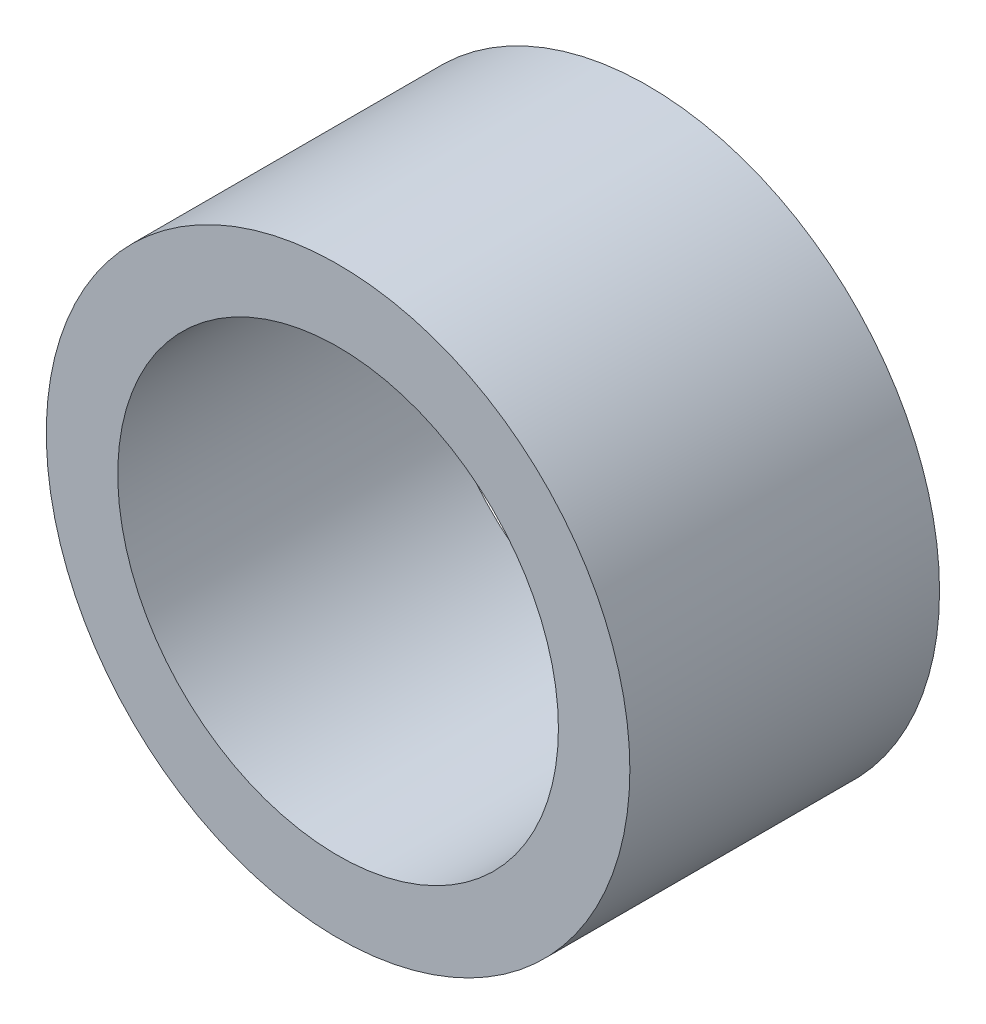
ISO-10303-21;
HEADER;
FILE_DESCRIPTION(('STEP AP214'),'2;1');
FILE_NAME('part.step','',(''),(''),'','','');
FILE_SCHEMA(('AUTOMOTIVE_DESIGN { 1 0 10303 214 1 1 1 1 }'));
ENDSEC;
DATA;
#1=APPLICATION_CONTEXT('core data for automotive mechanical design processes');
#2=APPLICATION_PROTOCOL_DEFINITION('international standard','automotive_design',2000,#1);
#3=PRODUCT_CONTEXT('',#1,'mechanical');
#4=PRODUCT('Part','Part','',(#3));
#5=PRODUCT_RELATED_PRODUCT_CATEGORY('part','',(#4));
#6=PRODUCT_DEFINITION_FORMATION('','',#4);
#7=PRODUCT_DEFINITION_CONTEXT('part definition',#1,'design');
#8=PRODUCT_DEFINITION('design','',#6,#7);
#9=PRODUCT_DEFINITION_SHAPE('','',#8);
#10=(LENGTH_UNIT() NAMED_UNIT(*) SI_UNIT(.MILLI.,.METRE.));
#11=(NAMED_UNIT(*) PLANE_ANGLE_UNIT() SI_UNIT($,.RADIAN.));
#12=(NAMED_UNIT(*) SI_UNIT($,.STERADIAN.) SOLID_ANGLE_UNIT());
#13=UNCERTAINTY_MEASURE_WITH_UNIT(LENGTH_MEASURE(1.E-05),#10,'distance_accuracy_value','');
#14=(GEOMETRIC_REPRESENTATION_CONTEXT(3) GLOBAL_UNCERTAINTY_ASSIGNED_CONTEXT((#13)) GLOBAL_UNIT_ASSIGNED_CONTEXT((#10,
#11,#12)) REPRESENTATION_CONTEXT('',''));
#15=CARTESIAN_POINT('',(0.,0.,0.));
#16=DIRECTION('',(0.,0.,1.));
#17=DIRECTION('',(1.,0.,0.));
#18=AXIS2_PLACEMENT_3D('',#15,#16,#17);
#19=CARTESIAN_POINT('',(0.,0.,-13.));
#20=DIRECTION('',(0.,0.,1.));
#21=DIRECTION('',(1.,0.,0.));
#22=AXIS2_PLACEMENT_3D('',#19,#20,#21);
#23=CYLINDRICAL_SURFACE('',#22,12.25);
#24=CARTESIAN_POINT('',(0.,0.,-13.));
#25=DIRECTION('',(0.,0.,1.));
#26=DIRECTION('',(1.,0.,0.));
#27=AXIS2_PLACEMENT_3D('',#24,#25,#26);
#28=CIRCLE('',#27,12.25);
#29=CARTESIAN_POINT('',(12.25,0.,-13.));
#30=VERTEX_POINT('',#29);
#31=EDGE_CURVE('E11',#30,#30,#28,.T.);
#32=CARTESIAN_POINT('',(0.,0.,0.));
#33=DIRECTION('',(0.,0.,1.));
#34=DIRECTION('',(1.,0.,0.));
#35=AXIS2_PLACEMENT_3D('',#32,#33,#34);
#36=CIRCLE('',#35,12.25);
#37=CARTESIAN_POINT('',(12.25,0.,0.));
#38=VERTEX_POINT('',#37);
#39=EDGE_CURVE('E44',#38,#38,#36,.T.);
#40=CARTESIAN_POINT('',(12.25,0.,-13.));
#41=CARTESIAN_POINT('',(12.25,0.,-12.8645833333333));
#42=CARTESIAN_POINT('',(12.25,0.,-12.7291666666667));
#43=CARTESIAN_POINT('',(12.25,0.,-12.4583333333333));
#44=CARTESIAN_POINT('',(12.25,0.,-12.3229166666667));
#45=CARTESIAN_POINT('',(12.25,0.,-12.0520833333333));
#46=CARTESIAN_POINT('',(12.25,0.,-11.9166666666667));
#47=CARTESIAN_POINT('',(12.25,0.,-11.6458333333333));
#48=CARTESIAN_POINT('',(12.25,0.,-11.5104166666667));
#49=CARTESIAN_POINT('',(12.25,0.,-11.2395833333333));
#50=CARTESIAN_POINT('',(12.25,0.,-11.1041666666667));
#51=CARTESIAN_POINT('',(12.25,0.,-10.8333333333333));
#52=CARTESIAN_POINT('',(12.25,0.,-10.6979166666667));
#53=CARTESIAN_POINT('',(12.25,0.,-10.4270833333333));
#54=CARTESIAN_POINT('',(12.25,0.,-10.2916666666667));
#55=CARTESIAN_POINT('',(12.25,0.,-10.0208333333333));
#56=CARTESIAN_POINT('',(12.25,0.,-9.88541666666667));
#57=CARTESIAN_POINT('',(12.25,0.,-9.61458333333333));
#58=CARTESIAN_POINT('',(12.25,0.,-9.47916666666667));
#59=CARTESIAN_POINT('',(12.25,0.,-9.20833333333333));
#60=CARTESIAN_POINT('',(12.25,0.,-9.07291666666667));
#61=CARTESIAN_POINT('',(12.25,0.,-8.80208333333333));
#62=CARTESIAN_POINT('',(12.25,0.,-8.66666666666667));
#63=CARTESIAN_POINT('',(12.25,0.,-8.39583333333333));
#64=CARTESIAN_POINT('',(12.25,0.,-8.26041666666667));
#65=CARTESIAN_POINT('',(12.25,0.,-7.98958333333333));
#66=CARTESIAN_POINT('',(12.25,0.,-7.85416666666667));
#67=CARTESIAN_POINT('',(12.25,0.,-7.58333333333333));
#68=CARTESIAN_POINT('',(12.25,0.,-7.44791666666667));
#69=CARTESIAN_POINT('',(12.25,0.,-7.17708333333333));
#70=CARTESIAN_POINT('',(12.25,0.,-7.04166666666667));
#71=CARTESIAN_POINT('',(12.25,0.,-6.77083333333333));
#72=CARTESIAN_POINT('',(12.25,0.,-6.63541666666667));
#73=CARTESIAN_POINT('',(12.25,0.,-6.36458333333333));
#74=CARTESIAN_POINT('',(12.25,0.,-6.22916666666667));
#75=CARTESIAN_POINT('',(12.25,0.,-5.95833333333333));
#76=CARTESIAN_POINT('',(12.25,0.,-5.82291666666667));
#77=CARTESIAN_POINT('',(12.25,0.,-5.55208333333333));
#78=CARTESIAN_POINT('',(12.25,0.,-5.41666666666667));
#79=CARTESIAN_POINT('',(12.25,0.,-5.14583333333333));
#80=CARTESIAN_POINT('',(12.25,0.,-5.01041666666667));
#81=CARTESIAN_POINT('',(12.25,0.,-4.73958333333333));
#82=CARTESIAN_POINT('',(12.25,0.,-4.60416666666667));
#83=CARTESIAN_POINT('',(12.25,0.,-4.33333333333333));
#84=CARTESIAN_POINT('',(12.25,0.,-4.19791666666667));
#85=CARTESIAN_POINT('',(12.25,0.,-3.92708333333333));
#86=CARTESIAN_POINT('',(12.25,0.,-3.79166666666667));
#87=CARTESIAN_POINT('',(12.25,0.,-3.52083333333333));
#88=CARTESIAN_POINT('',(12.25,0.,-3.38541666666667));
#89=CARTESIAN_POINT('',(12.25,0.,-3.11458333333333));
#90=CARTESIAN_POINT('',(12.25,0.,-2.97916666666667));
#91=CARTESIAN_POINT('',(12.25,0.,-2.70833333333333));
#92=CARTESIAN_POINT('',(12.25,0.,-2.57291666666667));
#93=CARTESIAN_POINT('',(12.25,0.,-2.30208333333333));
#94=CARTESIAN_POINT('',(12.25,0.,-2.16666666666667));
#95=CARTESIAN_POINT('',(12.25,0.,-1.89583333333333));
#96=CARTESIAN_POINT('',(12.25,0.,-1.76041666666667));
#97=CARTESIAN_POINT('',(12.25,0.,-1.48958333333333));
#98=CARTESIAN_POINT('',(12.25,0.,-1.35416666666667));
#99=CARTESIAN_POINT('',(12.25,0.,-1.08333333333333));
#100=CARTESIAN_POINT('',(12.25,0.,-0.947916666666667));
#101=CARTESIAN_POINT('',(12.25,0.,-0.677083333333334));
#102=CARTESIAN_POINT('',(12.25,0.,-0.541666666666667));
#103=CARTESIAN_POINT('',(12.25,0.,-0.270833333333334));
#104=CARTESIAN_POINT('',(12.25,0.,-0.135416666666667));
#105=CARTESIAN_POINT('',(12.25,0.,0.));
#106=B_SPLINE_CURVE_WITH_KNOTS('',3,(#40,#41,#42,#43,#44,#45,#46,#47,#48,#49,#50,#51,#52,#53,
#54,#55,#56,#57,#58,#59,#60,#61,#62,#63,#64,#65,#66,#67,#68,#69,#70,#71,#72,#73,#74,#75,#76,#77,
#78,#79,#80,#81,#82,#83,#84,#85,#86,#87,#88,#89,#90,#91,#92,#93,#94,#95,#96,#97,#98,#99,#100,
#101,#102,#103,#104,#105),.UNSPECIFIED.,.F.,.F.,(4,2,2,2,2,2,2,2,2,2,2,2,2,2,2,2,2,2,2,2,2,2,2,
2,2,2,2,2,2,2,2,2,4),(0.,0.406249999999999,0.812499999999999,1.21875,1.625,2.03125,2.4375,
2.84375,3.25,3.65625,4.0625,4.46875,4.875,5.28125,5.6875,6.09375,6.5,6.90625,7.3125,7.71875,
8.125,8.53125,8.9375,9.34375,9.75,10.15625,10.5625,10.96875,11.375,11.78125,12.1875,12.59375,
13.),.UNSPECIFIED.);
#107=EDGE_CURVE('BSEAM41',#30,#38,#106,.T.);
#108=ORIENTED_EDGE('',*,*,#31,.T.);
#109=ORIENTED_EDGE('',*,*,#39,.F.);
#110=ORIENTED_EDGE('',*,*,#107,.T.);
#111=ORIENTED_EDGE('',*,*,#107,.F.);
#112=EDGE_LOOP('',(#108,#110,#109,#111));
#113=FACE_BOUND('',#112,.T.);
#114=ADVANCED_FACE('F41',(#113),#23,.T.);
#115=CARTESIAN_POINT('',(0.,0.,-13.));
#116=DIRECTION('',(0.,0.,1.));
#117=DIRECTION('',(1.,0.,0.));
#118=AXIS2_PLACEMENT_3D('',#115,#116,#117);
#119=PLANE('',#118);
#120=CARTESIAN_POINT('',(0.,0.,-13.));
#121=DIRECTION('',(0.,0.,1.));
#122=DIRECTION('',(1.,0.,0.));
#123=AXIS2_PLACEMENT_3D('',#120,#121,#122);
#124=CIRCLE('',#123,9.25);
#125=CARTESIAN_POINT('',(9.25,0.,-13.));
#126=VERTEX_POINT('',#125);
#127=EDGE_CURVE('E51',#126,#126,#124,.T.);
#128=ORIENTED_EDGE('',*,*,#127,.T.);
#129=EDGE_LOOP('',(#128));
#130=FACE_BOUND('',#129,.T.);
#131=ORIENTED_EDGE('',*,*,#31,.F.);
#132=EDGE_LOOP('',(#131));
#133=FACE_BOUND('',#132,.T.);
#134=ADVANCED_FACE('F59',(#130,#133),#119,.F.);
#135=CARTESIAN_POINT('',(0.,0.,0.));
#136=DIRECTION('',(0.,0.,1.));
#137=DIRECTION('',(1.,0.,0.));
#138=AXIS2_PLACEMENT_3D('',#135,#136,#137);
#139=PLANE('',#138);
#140=CARTESIAN_POINT('',(0.,0.,0.));
#141=DIRECTION('',(0.,0.,1.));
#142=DIRECTION('',(1.,0.,0.));
#143=AXIS2_PLACEMENT_3D('',#140,#141,#142);
#144=CIRCLE('',#143,9.25);
#145=CARTESIAN_POINT('',(9.25,0.,0.));
#146=VERTEX_POINT('',#145);
#147=EDGE_CURVE('E53',#146,#146,#144,.T.);
#148=ORIENTED_EDGE('',*,*,#147,.F.);
#149=EDGE_LOOP('',(#148));
#150=FACE_BOUND('',#149,.T.);
#151=ORIENTED_EDGE('',*,*,#39,.T.);
#152=EDGE_LOOP('',(#151));
#153=FACE_BOUND('',#152,.T.);
#154=ADVANCED_FACE('F65',(#150,#153),#139,.T.);
#155=CARTESIAN_POINT('',(0.,0.,-13.));
#156=DIRECTION('',(0.,0.,1.));
#157=DIRECTION('',(1.,0.,0.));
#158=AXIS2_PLACEMENT_3D('',#155,#156,#157);
#159=CYLINDRICAL_SURFACE('',#158,9.25);
#160=CARTESIAN_POINT('',(9.25,0.,-13.));
#161=CARTESIAN_POINT('',(9.25,0.,-12.8645833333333));
#162=CARTESIAN_POINT('',(9.25,0.,-12.7291666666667));
#163=CARTESIAN_POINT('',(9.25,0.,-12.4583333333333));
#164=CARTESIAN_POINT('',(9.25,0.,-12.3229166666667));
#165=CARTESIAN_POINT('',(9.25,0.,-12.0520833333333));
#166=CARTESIAN_POINT('',(9.25,0.,-11.9166666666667));
#167=CARTESIAN_POINT('',(9.25,0.,-11.6458333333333));
#168=CARTESIAN_POINT('',(9.25,0.,-11.5104166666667));
#169=CARTESIAN_POINT('',(9.25,0.,-11.2395833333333));
#170=CARTESIAN_POINT('',(9.25,0.,-11.1041666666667));
#171=CARTESIAN_POINT('',(9.25,0.,-10.8333333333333));
#172=CARTESIAN_POINT('',(9.25,0.,-10.6979166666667));
#173=CARTESIAN_POINT('',(9.25,0.,-10.4270833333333));
#174=CARTESIAN_POINT('',(9.25,0.,-10.2916666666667));
#175=CARTESIAN_POINT('',(9.25,0.,-10.0208333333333));
#176=CARTESIAN_POINT('',(9.25,0.,-9.88541666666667));
#177=CARTESIAN_POINT('',(9.25,0.,-9.61458333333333));
#178=CARTESIAN_POINT('',(9.25,0.,-9.47916666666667));
#179=CARTESIAN_POINT('',(9.25,0.,-9.20833333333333));
#180=CARTESIAN_POINT('',(9.25,0.,-9.07291666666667));
#181=CARTESIAN_POINT('',(9.25,0.,-8.80208333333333));
#182=CARTESIAN_POINT('',(9.25,0.,-8.66666666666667));
#183=CARTESIAN_POINT('',(9.25,0.,-8.39583333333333));
#184=CARTESIAN_POINT('',(9.25,0.,-8.26041666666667));
#185=CARTESIAN_POINT('',(9.25,0.,-7.98958333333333));
#186=CARTESIAN_POINT('',(9.25,0.,-7.85416666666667));
#187=CARTESIAN_POINT('',(9.25,0.,-7.58333333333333));
#188=CARTESIAN_POINT('',(9.25,0.,-7.44791666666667));
#189=CARTESIAN_POINT('',(9.25,0.,-7.17708333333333));
#190=CARTESIAN_POINT('',(9.25,0.,-7.04166666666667));
#191=CARTESIAN_POINT('',(9.25,0.,-6.77083333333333));
#192=CARTESIAN_POINT('',(9.25,0.,-6.63541666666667));
#193=CARTESIAN_POINT('',(9.25,0.,-6.36458333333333));
#194=CARTESIAN_POINT('',(9.25,0.,-6.22916666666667));
#195=CARTESIAN_POINT('',(9.25,0.,-5.95833333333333));
#196=CARTESIAN_POINT('',(9.25,0.,-5.82291666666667));
#197=CARTESIAN_POINT('',(9.25,0.,-5.55208333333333));
#198=CARTESIAN_POINT('',(9.25,0.,-5.41666666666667));
#199=CARTESIAN_POINT('',(9.25,0.,-5.14583333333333));
#200=CARTESIAN_POINT('',(9.25,0.,-5.01041666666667));
#201=CARTESIAN_POINT('',(9.25,0.,-4.73958333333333));
#202=CARTESIAN_POINT('',(9.25,0.,-4.60416666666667));
#203=CARTESIAN_POINT('',(9.25,0.,-4.33333333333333));
#204=CARTESIAN_POINT('',(9.25,0.,-4.19791666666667));
#205=CARTESIAN_POINT('',(9.25,0.,-3.92708333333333));
#206=CARTESIAN_POINT('',(9.25,0.,-3.79166666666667));
#207=CARTESIAN_POINT('',(9.25,0.,-3.52083333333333));
#208=CARTESIAN_POINT('',(9.25,0.,-3.38541666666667));
#209=CARTESIAN_POINT('',(9.25,0.,-3.11458333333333));
#210=CARTESIAN_POINT('',(9.25,0.,-2.97916666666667));
#211=CARTESIAN_POINT('',(9.25,0.,-2.70833333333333));
#212=CARTESIAN_POINT('',(9.25,0.,-2.57291666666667));
#213=CARTESIAN_POINT('',(9.25,0.,-2.30208333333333));
#214=CARTESIAN_POINT('',(9.25,0.,-2.16666666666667));
#215=CARTESIAN_POINT('',(9.25,0.,-1.89583333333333));
#216=CARTESIAN_POINT('',(9.25,0.,-1.76041666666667));
#217=CARTESIAN_POINT('',(9.25,0.,-1.48958333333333));
#218=CARTESIAN_POINT('',(9.25,0.,-1.35416666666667));
#219=CARTESIAN_POINT('',(9.25,0.,-1.08333333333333));
#220=CARTESIAN_POINT('',(9.25,0.,-0.947916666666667));
#221=CARTESIAN_POINT('',(9.25,0.,-0.677083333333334));
#222=CARTESIAN_POINT('',(9.25,0.,-0.541666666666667));
#223=CARTESIAN_POINT('',(9.25,0.,-0.270833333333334));
#224=CARTESIAN_POINT('',(9.25,0.,-0.135416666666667));
#225=CARTESIAN_POINT('',(9.25,0.,0.));
#226=B_SPLINE_CURVE_WITH_KNOTS('',3,(#160,#161,#162,#163,#164,#165,#166,#167,#168,#169,#170,
#171,#172,#173,#174,#175,#176,#177,#178,#179,#180,#181,#182,#183,#184,#185,#186,#187,#188,#189,
#190,#191,#192,#193,#194,#195,#196,#197,#198,#199,#200,#201,#202,#203,#204,#205,#206,#207,#208,
#209,#210,#211,#212,#213,#214,#215,#216,#217,#218,#219,#220,#221,#222,#223,#224,#225),
.UNSPECIFIED.,.F.,.F.,(4,2,2,2,2,2,2,2,2,2,2,2,2,2,2,2,2,2,2,2,2,2,2,2,2,2,2,2,2,2,2,2,4),(0.,
0.406249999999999,0.812499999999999,1.21875,1.625,2.03125,2.4375,2.84375,3.25,3.65625,4.0625,
4.46875,4.875,5.28125,5.6875,6.09375,6.5,6.90625,7.3125,7.71875,8.125,8.53125,8.9375,9.34375,
9.75,10.15625,10.5625,10.96875,11.375,11.78125,12.1875,12.59375,13.),.UNSPECIFIED.);
#227=EDGE_CURVE('BSEAM62',#126,#146,#226,.T.);
#228=ORIENTED_EDGE('',*,*,#127,.F.);
#229=ORIENTED_EDGE('',*,*,#147,.T.);
#230=ORIENTED_EDGE('',*,*,#227,.T.);
#231=ORIENTED_EDGE('',*,*,#227,.F.);
#232=EDGE_LOOP('',(#228,#230,#229,#231));
#233=FACE_BOUND('',#232,.T.);
#234=ADVANCED_FACE('F62',(#233),#159,.F.);
#235=CLOSED_SHELL('',(#114,#134,#154,#234));
#236=MANIFOLD_SOLID_BREP('B2',#235);
#237=ADVANCED_BREP_SHAPE_REPRESENTATION('',(#18,#236),#14);
#238=SHAPE_DEFINITION_REPRESENTATION(#9,#237);
ENDSEC;
END-ISO-10303-21;
